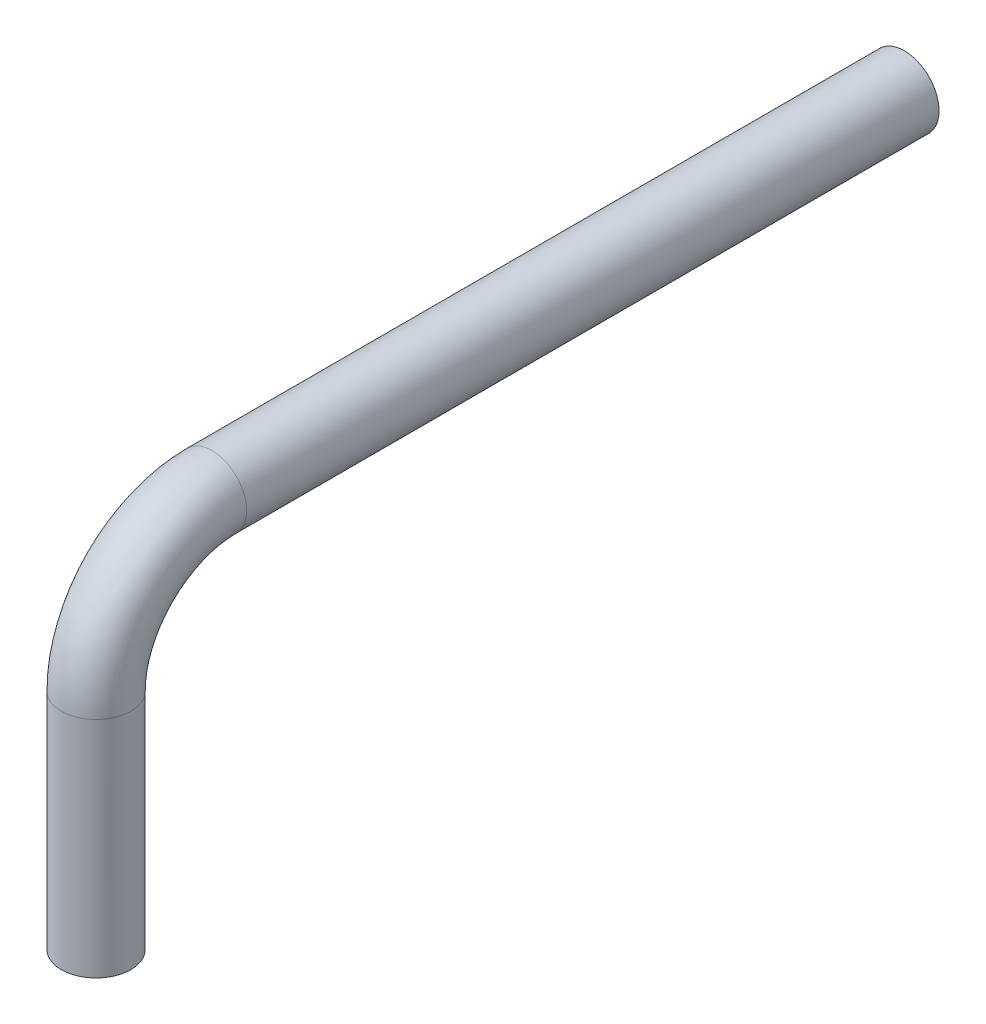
ISO-10303-21;
HEADER;
FILE_DESCRIPTION(('STEP AP214'),'2;1');
FILE_NAME('part.step','',(''),(''),'','','');
FILE_SCHEMA(('AUTOMOTIVE_DESIGN { 1 0 10303 214 1 1 1 1 }'));
ENDSEC;
DATA;
#1=APPLICATION_CONTEXT('core data for automotive mechanical design processes');
#2=APPLICATION_PROTOCOL_DEFINITION('international standard','automotive_design',2000,#1);
#3=PRODUCT_CONTEXT('',#1,'mechanical');
#4=PRODUCT('Part','Part','',(#3));
#5=PRODUCT_RELATED_PRODUCT_CATEGORY('part','',(#4));
#6=PRODUCT_DEFINITION_FORMATION('','',#4);
#7=PRODUCT_DEFINITION_CONTEXT('part definition',#1,'design');
#8=PRODUCT_DEFINITION('design','',#6,#7);
#9=PRODUCT_DEFINITION_SHAPE('','',#8);
#10=(LENGTH_UNIT() NAMED_UNIT(*) SI_UNIT(.MILLI.,.METRE.));
#11=(NAMED_UNIT(*) PLANE_ANGLE_UNIT() SI_UNIT($,.RADIAN.));
#12=(NAMED_UNIT(*) SI_UNIT($,.STERADIAN.) SOLID_ANGLE_UNIT());
#13=UNCERTAINTY_MEASURE_WITH_UNIT(LENGTH_MEASURE(1.E-05),#10,'distance_accuracy_value','');
#14=(GEOMETRIC_REPRESENTATION_CONTEXT(3) GLOBAL_UNCERTAINTY_ASSIGNED_CONTEXT((#13)) GLOBAL_UNIT_ASSIGNED_CONTEXT((#10,
#11,#12)) REPRESENTATION_CONTEXT('',''));
#15=CARTESIAN_POINT('',(0.,0.,0.));
#16=DIRECTION('',(0.,0.,1.));
#17=DIRECTION('',(1.,0.,0.));
#18=AXIS2_PLACEMENT_3D('',#15,#16,#17);
#19=CARTESIAN_POINT('',(0.,0.,12.7));
#20=DIRECTION('',(0.,0.,-1.));
#21=DIRECTION('',(-1.,0.,0.));
#22=AXIS2_PLACEMENT_3D('',#19,#20,#21);
#23=CYLINDRICAL_SURFACE('',#22,0.761999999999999);
#24=CARTESIAN_POINT('',(0.,0.,0.));
#25=DIRECTION('',(0.,0.,1.));
#26=DIRECTION('',(1.,0.,0.));
#27=AXIS2_PLACEMENT_3D('',#24,#25,#26);
#28=CIRCLE('',#27,0.761999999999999);
#29=CARTESIAN_POINT('',(0.761999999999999,0.,0.));
#30=VERTEX_POINT('',#29);
#31=EDGE_CURVE('E10',#30,#30,#28,.T.);
#32=ORIENTED_EDGE('',*,*,#31,.T.);
#33=EDGE_LOOP('',(#32));
#34=FACE_BOUND('',#33,.T.);
#35=CARTESIAN_POINT('',(0.,0.,15.1870610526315));
#36=DIRECTION('',(0.,0.,1.));
#37=DIRECTION('',(1.,0.,0.));
#38=AXIS2_PLACEMENT_3D('',#35,#36,#37);
#39=CIRCLE('',#38,0.761999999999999);
#40=CARTESIAN_POINT('',(0.,0.761999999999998,15.1870610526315));
#41=VERTEX_POINT('',#40);
#42=EDGE_CURVE('E41',#41,#41,#39,.T.);
#43=ORIENTED_EDGE('',*,*,#42,.F.);
#44=EDGE_LOOP('',(#43));
#45=FACE_BOUND('',#44,.T.);
#46=ADVANCED_FACE('F27',(#34,#45),#23,.T.);
#47=CARTESIAN_POINT('',(0.,0.,0.));
#48=DIRECTION('',(0.,0.,1.));
#49=DIRECTION('',(1.,0.,0.));
#50=AXIS2_PLACEMENT_3D('',#47,#48,#49);
#51=PLANE('',#50);
#52=ORIENTED_EDGE('',*,*,#31,.F.);
#53=EDGE_LOOP('',(#52));
#54=FACE_BOUND('',#53,.T.);
#55=ADVANCED_FACE('F51',(#54),#51,.F.);
#56=CARTESIAN_POINT('',(0.,-2.54000000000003,17.7270610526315));
#57=DIRECTION('',(0.,-1.,0.));
#58=DIRECTION('',(0.,0.,-1.));
#59=AXIS2_PLACEMENT_3D('',#56,#57,#58);
#60=CYLINDRICAL_SURFACE('',#59,0.761999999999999);
#61=CARTESIAN_POINT('',(0.,-2.54000000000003,17.7270610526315));
#62=DIRECTION('',(0.,-1.,0.));
#63=DIRECTION('',(1.,0.,0.));
#64=AXIS2_PLACEMENT_3D('',#61,#62,#63);
#65=CIRCLE('',#64,0.761999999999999);
#66=CARTESIAN_POINT('',(0.,-2.54000000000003,18.4890610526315));
#67=VERTEX_POINT('',#66);
#68=EDGE_CURVE('E37',#67,#67,#65,.T.);
#69=ORIENTED_EDGE('',*,*,#68,.T.);
#70=EDGE_LOOP('',(#69));
#71=FACE_BOUND('',#70,.T.);
#72=CARTESIAN_POINT('',(0.,-7.44995368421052,17.7270610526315));
#73=DIRECTION('',(0.,-1.,0.));
#74=DIRECTION('',(1.,0.,0.));
#75=AXIS2_PLACEMENT_3D('',#72,#73,#74);
#76=CIRCLE('',#75,0.761999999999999);
#77=CARTESIAN_POINT('',(0.761999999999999,-7.44995368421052,17.7270610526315));
#78=VERTEX_POINT('',#77);
#79=EDGE_CURVE('E33',#78,#78,#76,.T.);
#80=ORIENTED_EDGE('',*,*,#79,.F.);
#81=EDGE_LOOP('',(#80));
#82=FACE_BOUND('',#81,.T.);
#83=ADVANCED_FACE('F55',(#71,#82),#60,.T.);
#84=CARTESIAN_POINT('',(0.,-2.54,15.1870610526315));
#85=DIRECTION('',(1.,0.,0.));
#86=DIRECTION('',(0.,0.,-1.));
#87=AXIS2_PLACEMENT_3D('',#84,#85,#86);
#88=TOROIDAL_SURFACE('',#87,2.54,0.761999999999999);
#89=CARTESIAN_POINT('',(0.,-2.54,15.1870610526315));
#90=DIRECTION('',(1.,0.,0.));
#91=DIRECTION('',(0.,0.,-1.));
#92=AXIS2_PLACEMENT_3D('',#89,#90,#91);
#93=CIRCLE('',#92,3.302);
#94=EDGE_CURVE('',#41,#67,#93,.T.);
#95=ORIENTED_EDGE('',*,*,#42,.T.);
#96=ORIENTED_EDGE('',*,*,#68,.F.);
#97=ORIENTED_EDGE('',*,*,#94,.T.);
#98=ORIENTED_EDGE('',*,*,#94,.F.);
#99=EDGE_LOOP('',(#95,#97,#96,#98));
#100=FACE_BOUND('',#99,.T.);
#101=ADVANCED_FACE('F47',(#100),#88,.T.);
#102=CARTESIAN_POINT('',(0.,-7.44995368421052,17.7270610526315));
#103=DIRECTION('',(0.,-1.,0.));
#104=DIRECTION('',(1.,0.,0.));
#105=AXIS2_PLACEMENT_3D('',#102,#103,#104);
#106=PLANE('',#105);
#107=ORIENTED_EDGE('',*,*,#79,.T.);
#108=EDGE_LOOP('',(#107));
#109=FACE_BOUND('',#108,.T.);
#110=ADVANCED_FACE('F65',(#109),#106,.T.);
#111=CLOSED_SHELL('',(#46,#55,#83,#101,#110));
#112=MANIFOLD_SOLID_BREP('B2',#111);
#113=ADVANCED_BREP_SHAPE_REPRESENTATION('',(#18,#112),#14);
#114=SHAPE_DEFINITION_REPRESENTATION(#9,#113);
ENDSEC;
END-ISO-10303-21;
